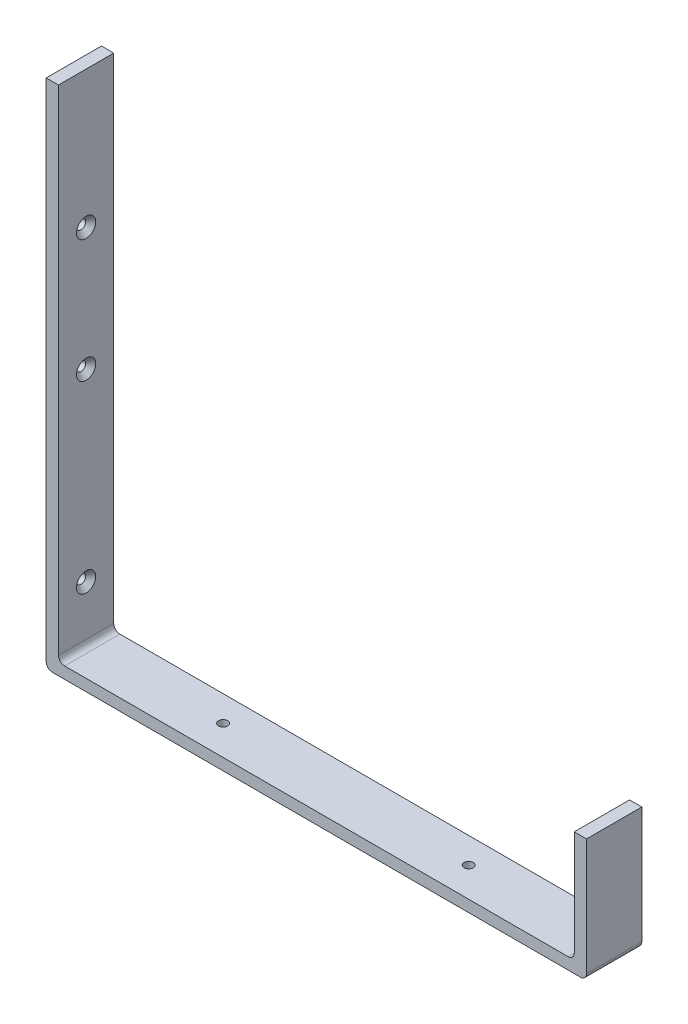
from build123d import *

# Parameters (mm, degrees)
BOSS_EXTRUDE1_DEPTH                             = 27
FILLET1_R                                       = 3
FILLET2_R                                       = 3
CSK_FOR_M4_FLAT_HEAD_MACHINE_SCREW1_D           = 4.5
CSK_FOR_M4_FLAT_HEAD_MACHINE_SCREW1_CSINK_D     = 9.4
CSK_FOR_M4_FLAT_HEAD_MACHINE_SCREW1_CSINK_ANGLE = 90
CSK_FOR_M4_FLAT_HEAD_MACHINE_SCREW2_D           = 4.5
CSK_FOR_M4_FLAT_HEAD_MACHINE_SCREW2_DEPTH       = 6
CSK_FOR_M4_FLAT_HEAD_MACHINE_SCREW2_CSINK_D     = 9.4
CSK_FOR_M4_FLAT_HEAD_MACHINE_SCREW2_CSINK_ANGLE = 90


with BuildPart() as part:
    # Sketch1 → Boss-Extrude1 (new body)
    with BuildSketch(Plane.XY):
        Polygon((132, -125), (132, -65), (126, -65), (126, -119.318181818), (-126, -119.318181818), (-126, 125), (-132, 125), (-132, -125), align=None)
    extrude(amount=BOSS_EXTRUDE1_DEPTH)

    # Fillet1
    fillet1_edges = [part.edges().sort_by_distance(p)[0] for p in [
        (132, -125, 13.5),
        (-132, -125, 13.5),
    ]]
    fillet(fillet1_edges, radius=FILLET1_R)

    # Fillet2
    fillet2_edges = [part.edges().sort_by_distance(p)[0] for p in [
        (-126, -119.318181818, 13.5),
        (126, -119.318181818, 13.5),
    ]]
    fillet(fillet2_edges, radius=FILLET2_R)

    # CSK for M4 Flat Head Machine Screw1 (through all)
    with Locations(Plane(origin=(0, -125, 0), x_dir=(-1, 0, 0), z_dir=(0, -1, 0))):
        with Locations((60, -12.572145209), (-60, -12.572145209)):
            CounterSinkHole(CSK_FOR_M4_FLAT_HEAD_MACHINE_SCREW1_D / 2, CSK_FOR_M4_FLAT_HEAD_MACHINE_SCREW1_CSINK_D / 2, counter_sink_angle=CSK_FOR_M4_FLAT_HEAD_MACHINE_SCREW1_CSINK_ANGLE)

    # CSK for M4 Flat Head Machine Screw2
    with Locations(Plane(origin=(-126, 0, 0), x_dir=(0, 0, -1), z_dir=(1, 0, 0))):
        with Locations((-13.5, -92), (-13.5, 58), (-13.5, -2)):
            CounterSinkHole(CSK_FOR_M4_FLAT_HEAD_MACHINE_SCREW2_D / 2, CSK_FOR_M4_FLAT_HEAD_MACHINE_SCREW2_CSINK_D / 2, depth=CSK_FOR_M4_FLAT_HEAD_MACHINE_SCREW2_DEPTH, counter_sink_angle=CSK_FOR_M4_FLAT_HEAD_MACHINE_SCREW2_CSINK_ANGLE)


solid = part.part
